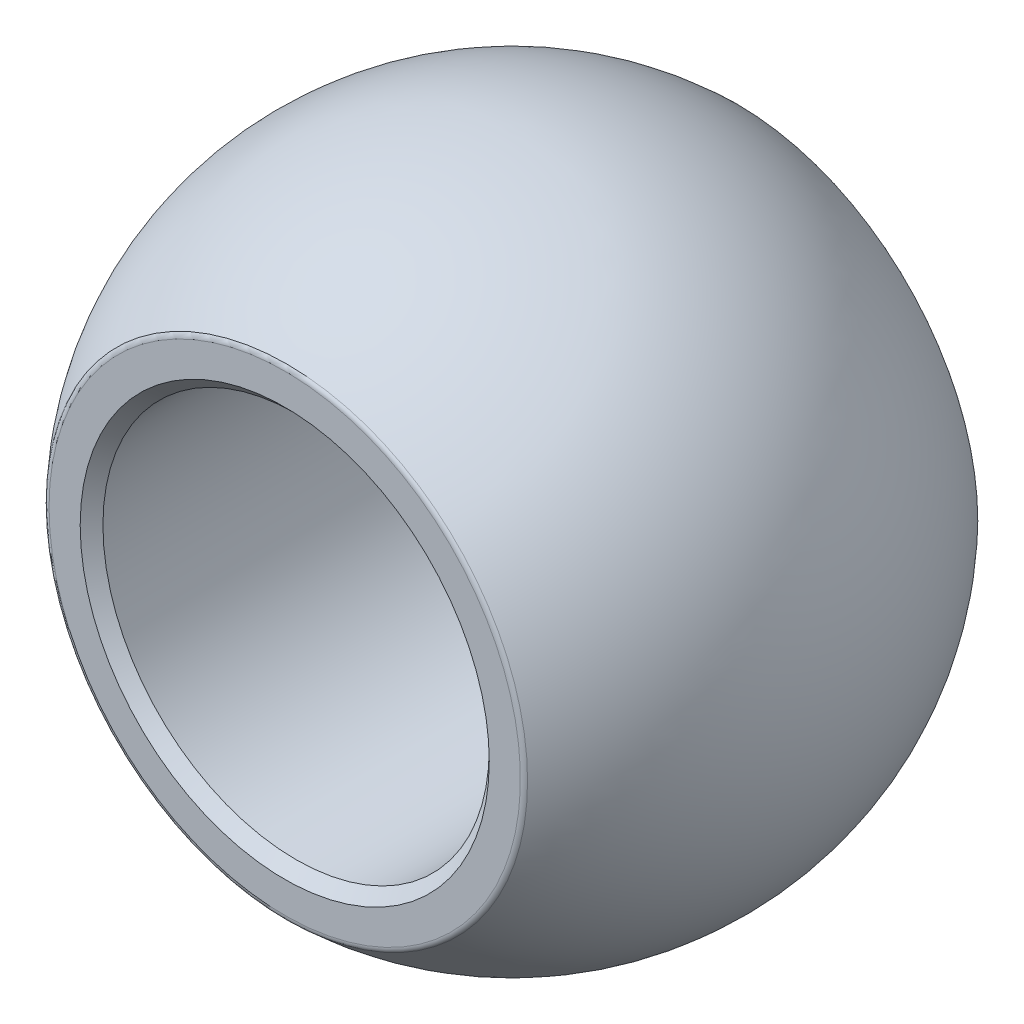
ISO-10303-21;
HEADER;
FILE_DESCRIPTION(('STEP AP214'),'2;1');
FILE_NAME('part.step','',(''),(''),'','','');
FILE_SCHEMA(('AUTOMOTIVE_DESIGN { 1 0 10303 214 1 1 1 1 }'));
ENDSEC;
DATA;
#1=APPLICATION_CONTEXT('core data for automotive mechanical design processes');
#2=APPLICATION_PROTOCOL_DEFINITION('international standard','automotive_design',2000,#1);
#3=PRODUCT_CONTEXT('',#1,'mechanical');
#4=PRODUCT('Part','Part','',(#3));
#5=PRODUCT_RELATED_PRODUCT_CATEGORY('part','',(#4));
#6=PRODUCT_DEFINITION_FORMATION('','',#4);
#7=PRODUCT_DEFINITION_CONTEXT('part definition',#1,'design');
#8=PRODUCT_DEFINITION('design','',#6,#7);
#9=PRODUCT_DEFINITION_SHAPE('','',#8);
#10=(LENGTH_UNIT() NAMED_UNIT(*) SI_UNIT(.MILLI.,.METRE.));
#11=(NAMED_UNIT(*) PLANE_ANGLE_UNIT() SI_UNIT($,.RADIAN.));
#12=(NAMED_UNIT(*) SI_UNIT($,.STERADIAN.) SOLID_ANGLE_UNIT());
#13=UNCERTAINTY_MEASURE_WITH_UNIT(LENGTH_MEASURE(1.E-05),#10,'distance_accuracy_value','');
#14=(GEOMETRIC_REPRESENTATION_CONTEXT(3) GLOBAL_UNCERTAINTY_ASSIGNED_CONTEXT((#13)) GLOBAL_UNIT_ASSIGNED_CONTEXT((#10,
#11,#12)) REPRESENTATION_CONTEXT('',''));
#15=CARTESIAN_POINT('',(0.,0.,0.));
#16=DIRECTION('',(0.,0.,1.));
#17=DIRECTION('',(1.,0.,0.));
#18=AXIS2_PLACEMENT_3D('',#15,#16,#17);
#19=CARTESIAN_POINT('',(0.,0.,0.));
#20=DIRECTION('',(0.,0.,1.));
#21=DIRECTION('',(0.,1.,0.));
#22=AXIS2_PLACEMENT_3D('',#19,#20,#21);
#23=SPHERICAL_SURFACE('',#22,14.5);
#24=CARTESIAN_POINT('',(-1.33226762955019E-12,-1.11022302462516E-13,-9.90492957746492));
#25=DIRECTION('',(0.,0.,1.));
#26=DIRECTION('',(1.,0.,0.));
#27=AXIS2_PLACEMENT_3D('',#24,#25,#26);
#28=CIRCLE('',#27,10.5897294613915);
#29=CARTESIAN_POINT('',(0.,10.5897294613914,-9.90492957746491));
#30=VERTEX_POINT('',#29);
#31=EDGE_CURVE('E40',#30,#30,#28,.T.);
#32=CARTESIAN_POINT('',(-2.22044604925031E-13,-2.22044604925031E-13,9.90492957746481));
#33=DIRECTION('',(0.,0.,-1.));
#34=DIRECTION('',(-1.,0.,0.));
#35=AXIS2_PLACEMENT_3D('',#32,#33,#34);
#36=CIRCLE('',#35,10.5897294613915);
#37=CARTESIAN_POINT('',(0.,10.5897294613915,9.90492957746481));
#38=VERTEX_POINT('',#37);
#39=EDGE_CURVE('E44',#38,#38,#36,.T.);
#40=CARTESIAN_POINT('',(0.,10.5897294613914,-9.90492957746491));
#41=CARTESIAN_POINT('',(0.,10.7449092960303,-9.7390272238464));
#42=CARTESIAN_POINT('',(0.,10.8961840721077,-9.56947280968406));
#43=CARTESIAN_POINT('',(0.,11.1906035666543,-9.22344638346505));
#44=CARTESIAN_POINT('',(0.,11.3337482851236,-9.04697437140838));
#45=CARTESIAN_POINT('',(0.,11.6115877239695,-8.68749927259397));
#46=CARTESIAN_POINT('',(0.,11.7462824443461,-8.50449618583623));
#47=CARTESIAN_POINT('',(0.,12.0069254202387,-8.13236397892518));
#48=CARTESIAN_POINT('',(0.,12.1328736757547,-7.94323485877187));
#49=CARTESIAN_POINT('',(0.,12.3757452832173,-7.55926805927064));
#50=CARTESIAN_POINT('',(0.,12.4926686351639,-7.36443037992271));
#51=CARTESIAN_POINT('',(0.,12.7172322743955,-6.96947683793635));
#52=CARTESIAN_POINT('',(0.,12.8248725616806,-6.76936097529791));
#53=CARTESIAN_POINT('',(0.,13.0306323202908,-6.36429302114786));
#54=CARTESIAN_POINT('',(0.,13.128751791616,-6.15934092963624));
#55=CARTESIAN_POINT('',(0.,13.3152532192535,-5.74505317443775));
#56=CARTESIAN_POINT('',(0.,13.4036351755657,-5.53571751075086));
#57=CARTESIAN_POINT('',(0.,13.5704663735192,-5.113124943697));
#58=CARTESIAN_POINT('',(0.,13.6489156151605,-4.89986804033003));
#59=CARTESIAN_POINT('',(0.,13.7957081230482,-4.46990398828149));
#60=CARTESIAN_POINT('',(0.,13.8640513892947,-4.25319683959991));
#61=CARTESIAN_POINT('',(0.,13.9904810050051,-3.81681091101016));
#62=CARTESIAN_POINT('',(0.,14.048567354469,-3.59713213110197));
#63=CARTESIAN_POINT('',(0.,14.154354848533,-3.15528811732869));
#64=CARTESIAN_POINT('',(0.,14.2020559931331,-2.9331228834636));
#65=CARTESIAN_POINT('',(0.,14.2869677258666,-2.48679663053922));
#66=CARTESIAN_POINT('',(0.,14.324178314,-2.26263561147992));
#67=CARTESIAN_POINT('',(0.,14.3880267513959,-1.81281286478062));
#68=CARTESIAN_POINT('',(0.,14.4146646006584,-1.58715113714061));
#69=CARTESIAN_POINT('',(0.,14.4573087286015,-1.13482536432));
#70=CARTESIAN_POINT('',(0.,14.4733150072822,-0.908161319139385));
#71=CARTESIAN_POINT('',(0.,14.4946606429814,-0.454331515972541));
#72=CARTESIAN_POINT('',(0.,14.5,-0.227165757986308));
#73=CARTESIAN_POINT('',(0.,14.5,0.22716575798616));
#74=CARTESIAN_POINT('',(0.,14.4946606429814,0.454331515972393));
#75=CARTESIAN_POINT('',(0.,14.4733150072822,0.908161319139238));
#76=CARTESIAN_POINT('',(0.,14.4573087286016,1.13482536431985));
#77=CARTESIAN_POINT('',(0.,14.4146646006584,1.58715113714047));
#78=CARTESIAN_POINT('',(0.,14.3880267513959,1.81281286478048));
#79=CARTESIAN_POINT('',(0.,14.324178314,2.26263561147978));
#80=CARTESIAN_POINT('',(0.,14.2869677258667,2.48679663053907));
#81=CARTESIAN_POINT('',(0.,14.2020559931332,2.93312288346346));
#82=CARTESIAN_POINT('',(0.,14.154354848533,3.15528811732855));
#83=CARTESIAN_POINT('',(0.,14.048567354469,3.59713213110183));
#84=CARTESIAN_POINT('',(0.,13.9904810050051,3.81681091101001));
#85=CARTESIAN_POINT('',(0.,13.8640513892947,4.25319683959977));
#86=CARTESIAN_POINT('',(0.,13.7957081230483,4.46990398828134));
#87=CARTESIAN_POINT('',(0.,13.6489156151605,4.89986804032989));
#88=CARTESIAN_POINT('',(0.,13.5704663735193,5.11312494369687));
#89=CARTESIAN_POINT('',(0.,13.4036351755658,5.53571751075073));
#90=CARTESIAN_POINT('',(0.,13.3152532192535,5.74505317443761));
#91=CARTESIAN_POINT('',(0.,13.128751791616,6.15934092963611));
#92=CARTESIAN_POINT('',(0.,13.0306323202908,6.36429302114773));
#93=CARTESIAN_POINT('',(0.,12.8248725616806,6.76936097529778));
#94=CARTESIAN_POINT('',(0.,12.7172322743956,6.96947683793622));
#95=CARTESIAN_POINT('',(0.,12.492668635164,7.36443037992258));
#96=CARTESIAN_POINT('',(0.,12.3757452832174,7.55926805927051));
#97=CARTESIAN_POINT('',(0.,12.1328736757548,7.94323485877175));
#98=CARTESIAN_POINT('',(0.,12.0069254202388,8.13236397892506));
#99=CARTESIAN_POINT('',(0.,11.7462824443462,8.50449618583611));
#100=CARTESIAN_POINT('',(0.,11.6115877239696,8.68749927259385));
#101=CARTESIAN_POINT('',(0.,11.3337482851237,9.04697437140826));
#102=CARTESIAN_POINT('',(0.,11.1906035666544,9.22344638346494));
#103=CARTESIAN_POINT('',(0.,10.8961840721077,9.56947280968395));
#104=CARTESIAN_POINT('',(0.,10.7449092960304,9.73902722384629));
#105=CARTESIAN_POINT('',(0.,10.5897294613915,9.90492957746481));
#106=B_SPLINE_CURVE_WITH_KNOTS('',3,(#40,#41,#42,#43,#44,#45,#46,#47,#48,#49,#50,#51,#52,#53,
#54,#55,#56,#57,#58,#59,#60,#61,#62,#63,#64,#65,#66,#67,#68,#69,#70,#71,#72,#73,#74,#75,#76,#77,
#78,#79,#80,#81,#82,#83,#84,#85,#86,#87,#88,#89,#90,#91,#92,#93,#94,#95,#96,#97,#98,#99,#100,
#101,#102,#103,#104,#105),.UNSPECIFIED.,.F.,.F.,(4,2,2,2,2,2,2,2,2,2,2,2,2,2,2,2,2,2,2,2,2,2,2,
2,2,2,2,2,2,2,2,2,4),(0.,0.681434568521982,1.36286913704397,2.04430370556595,2.72573827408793,
3.40717284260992,4.0886074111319,4.77004197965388,5.45147654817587,6.13291111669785,
6.81434568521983,7.49578025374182,8.1772148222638,8.85864939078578,9.54008395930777,
10.2215185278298,10.9029530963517,11.5843876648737,12.2658222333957,12.9472568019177,
13.6286913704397,14.3101259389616,14.9915605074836,15.6729950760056,16.3544296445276,
17.0358642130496,17.7172987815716,18.3987333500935,19.0801679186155,19.7616024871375,
20.4430370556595,21.1244716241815,21.8059061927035),.UNSPECIFIED.);
#107=EDGE_CURVE('BSEAM30',#30,#38,#106,.T.);
#108=ORIENTED_EDGE('',*,*,#31,.T.);
#109=ORIENTED_EDGE('',*,*,#39,.T.);
#110=ORIENTED_EDGE('',*,*,#107,.T.);
#111=ORIENTED_EDGE('',*,*,#107,.F.);
#112=EDGE_LOOP('',(#108,#110,#109,#111));
#113=FACE_BOUND('',#112,.T.);
#114=ADVANCED_FACE('F30',(#113),#23,.T.);
#115=CARTESIAN_POINT('',(0.,10.4999999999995,9.99999999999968));
#116=DIRECTION('',(0.,0.,-1.));
#117=DIRECTION('',(-1.,0.,0.));
#118=AXIS2_PLACEMENT_3D('',#115,#116,#117);
#119=PLANE('',#118);
#120=CARTESIAN_POINT('',(-8.88178419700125E-13,-2.22044604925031E-13,9.99999999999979));
#121=DIRECTION('',(0.,0.,-1.));
#122=DIRECTION('',(-1.,0.,0.));
#123=AXIS2_PLACEMENT_3D('',#120,#121,#122);
#124=CIRCLE('',#123,10.3706316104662);
#125=CARTESIAN_POINT('',(-10.370631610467,-2.22044604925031E-13,9.99999999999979));
#126=VERTEX_POINT('',#125);
#127=EDGE_CURVE('E10',#126,#126,#124,.F.);
#128=ORIENTED_EDGE('',*,*,#127,.T.);
#129=EDGE_LOOP('',(#128));
#130=FACE_BOUND('',#129,.T.);
#131=CARTESIAN_POINT('',(-8.88178419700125E-13,-2.22044604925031E-13,9.99999999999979));
#132=DIRECTION('',(0.,0.,-1.));
#133=DIRECTION('',(-1.,0.,0.));
#134=AXIS2_PLACEMENT_3D('',#131,#132,#133);
#135=CIRCLE('',#134,9.);
#136=CARTESIAN_POINT('',(-9.00000000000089,-2.22044604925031E-13,9.99999999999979));
#137=VERTEX_POINT('',#136);
#138=EDGE_CURVE('E52',#137,#137,#135,.T.);
#139=ORIENTED_EDGE('',*,*,#138,.T.);
#140=EDGE_LOOP('',(#139));
#141=FACE_BOUND('',#140,.T.);
#142=ADVANCED_FACE('F81',(#130,#141),#119,.F.);
#143=CARTESIAN_POINT('',(0.,-3.33066907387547E-13,24.3202429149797));
#144=DIRECTION('',(0.,0.,1.));
#145=DIRECTION('',(1.,0.,0.));
#146=AXIS2_PLACEMENT_3D('',#143,#144,#145);
#147=CYLINDRICAL_SURFACE('',#146,8.5);
#148=CARTESIAN_POINT('',(-1.11022302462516E-12,-2.22044604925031E-13,9.5000000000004));
#149=DIRECTION('',(0.,0.,-1.));
#150=DIRECTION('',(-1.,0.,0.));
#151=AXIS2_PLACEMENT_3D('',#148,#149,#150);
#152=CIRCLE('',#151,8.5);
#153=CARTESIAN_POINT('',(-8.5000000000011,-2.22044604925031E-13,9.5000000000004));
#154=VERTEX_POINT('',#153);
#155=EDGE_CURVE('E55',#154,#154,#152,.F.);
#156=ORIENTED_EDGE('',*,*,#155,.T.);
#157=EDGE_LOOP('',(#156));
#158=FACE_BOUND('',#157,.T.);
#159=CARTESIAN_POINT('',(-1.33226762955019E-12,-4.44089209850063E-13,-9.50000000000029));
#160=DIRECTION('',(0.,0.,1.));
#161=DIRECTION('',(1.,0.,0.));
#162=AXIS2_PLACEMENT_3D('',#159,#160,#161);
#163=CIRCLE('',#162,8.5);
#164=CARTESIAN_POINT('',(8.49999999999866,-4.44089209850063E-13,-9.50000000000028));
#165=VERTEX_POINT('',#164);
#166=EDGE_CURVE('E58',#165,#165,#163,.F.);
#167=ORIENTED_EDGE('',*,*,#166,.T.);
#168=EDGE_LOOP('',(#167));
#169=FACE_BOUND('',#168,.T.);
#170=ADVANCED_FACE('F62',(#158,#169),#147,.F.);
#171=CARTESIAN_POINT('',(0.,10.5,-10.0000000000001));
#172=DIRECTION('',(0.,0.,1.));
#173=DIRECTION('',(1.,0.,0.));
#174=AXIS2_PLACEMENT_3D('',#171,#172,#173);
#175=PLANE('',#174);
#176=CARTESIAN_POINT('',(-8.88178419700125E-13,-3.33066907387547E-13,-10.0000000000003));
#177=DIRECTION('',(0.,0.,1.));
#178=DIRECTION('',(1.,0.,0.));
#179=AXIS2_PLACEMENT_3D('',#176,#177,#178);
#180=CIRCLE('',#179,10.3706316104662);
#181=CARTESIAN_POINT('',(10.3706316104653,-3.33066907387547E-13,-10.0000000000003));
#182=VERTEX_POINT('',#181);
#183=EDGE_CURVE('E36',#182,#182,#180,.F.);
#184=ORIENTED_EDGE('',*,*,#183,.T.);
#185=EDGE_LOOP('',(#184));
#186=FACE_BOUND('',#185,.T.);
#187=CARTESIAN_POINT('',(-8.88178419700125E-13,-3.33066907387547E-13,-10.0000000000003));
#188=DIRECTION('',(0.,0.,1.));
#189=DIRECTION('',(1.,0.,0.));
#190=AXIS2_PLACEMENT_3D('',#187,#188,#189);
#191=CIRCLE('',#190,9.);
#192=CARTESIAN_POINT('',(8.99999999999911,-3.33066907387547E-13,-10.0000000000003));
#193=VERTEX_POINT('',#192);
#194=EDGE_CURVE('E49',#193,#193,#191,.T.);
#195=ORIENTED_EDGE('',*,*,#194,.T.);
#196=EDGE_LOOP('',(#195));
#197=FACE_BOUND('',#196,.T.);
#198=ADVANCED_FACE('F72',(#186,#197),#175,.F.);
#199=CARTESIAN_POINT('',(-1.11022302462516E-12,-2.22044604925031E-13,9.5000000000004));
#200=DIRECTION('',(0.,0.,1.));
#201=DIRECTION('',(1.,0.,0.));
#202=AXIS2_PLACEMENT_3D('',#199,#200,#201);
#203=CONICAL_SURFACE('',#202,8.5,0.78539816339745);
#204=ORIENTED_EDGE('',*,*,#138,.F.);
#205=EDGE_LOOP('',(#204));
#206=FACE_BOUND('',#205,.T.);
#207=ORIENTED_EDGE('',*,*,#155,.F.);
#208=EDGE_LOOP('',(#207));
#209=FACE_BOUND('',#208,.T.);
#210=ADVANCED_FACE('F68',(#206,#209),#203,.F.);
#211=CARTESIAN_POINT('',(-8.88178419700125E-13,-3.33066907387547E-13,-10.0000000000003));
#212=DIRECTION('',(0.,0.,-1.));
#213=DIRECTION('',(-1.,0.,0.));
#214=AXIS2_PLACEMENT_3D('',#211,#212,#213);
#215=CONICAL_SURFACE('',#214,9.,0.785398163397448);
#216=ORIENTED_EDGE('',*,*,#166,.F.);
#217=EDGE_LOOP('',(#216));
#218=FACE_BOUND('',#217,.T.);
#219=ORIENTED_EDGE('',*,*,#194,.F.);
#220=EDGE_LOOP('',(#219));
#221=FACE_BOUND('',#220,.T.);
#222=ADVANCED_FACE('F64',(#218,#221),#215,.F.);
#223=CARTESIAN_POINT('',(-2.22044604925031E-13,1.11022302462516E-13,-9.70000000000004));
#224=DIRECTION('',(0.,0.,1.));
#225=DIRECTION('',(1.,0.,0.));
#226=AXIS2_PLACEMENT_3D('',#223,#224,#225);
#227=TOROIDAL_SURFACE('',#226,10.3706316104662,0.3);
#228=ORIENTED_EDGE('',*,*,#183,.F.);
#229=EDGE_LOOP('',(#228));
#230=FACE_BOUND('',#229,.T.);
#231=ORIENTED_EDGE('',*,*,#31,.F.);
#232=EDGE_LOOP('',(#231));
#233=FACE_BOUND('',#232,.T.);
#234=ADVANCED_FACE('F67',(#230,#233),#227,.T.);
#235=CARTESIAN_POINT('',(-1.33226762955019E-12,-2.22044604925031E-13,9.69999999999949));
#236=DIRECTION('',(0.,0.,-1.));
#237=DIRECTION('',(-1.,0.,0.));
#238=AXIS2_PLACEMENT_3D('',#235,#236,#237);
#239=TOROIDAL_SURFACE('',#238,10.3706316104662,0.3);
#240=ORIENTED_EDGE('',*,*,#39,.F.);
#241=EDGE_LOOP('',(#240));
#242=FACE_BOUND('',#241,.T.);
#243=ORIENTED_EDGE('',*,*,#127,.F.);
#244=EDGE_LOOP('',(#243));
#245=FACE_BOUND('',#244,.T.);
#246=ADVANCED_FACE('F93',(#242,#245),#239,.T.);
#247=CLOSED_SHELL('',(#114,#142,#170,#198,#210,#222,#234,#246));
#248=MANIFOLD_SOLID_BREP('B2',#247);
#249=ADVANCED_BREP_SHAPE_REPRESENTATION('',(#18,#248),#14);
#250=SHAPE_DEFINITION_REPRESENTATION(#9,#249);
ENDSEC;
END-ISO-10303-21;
